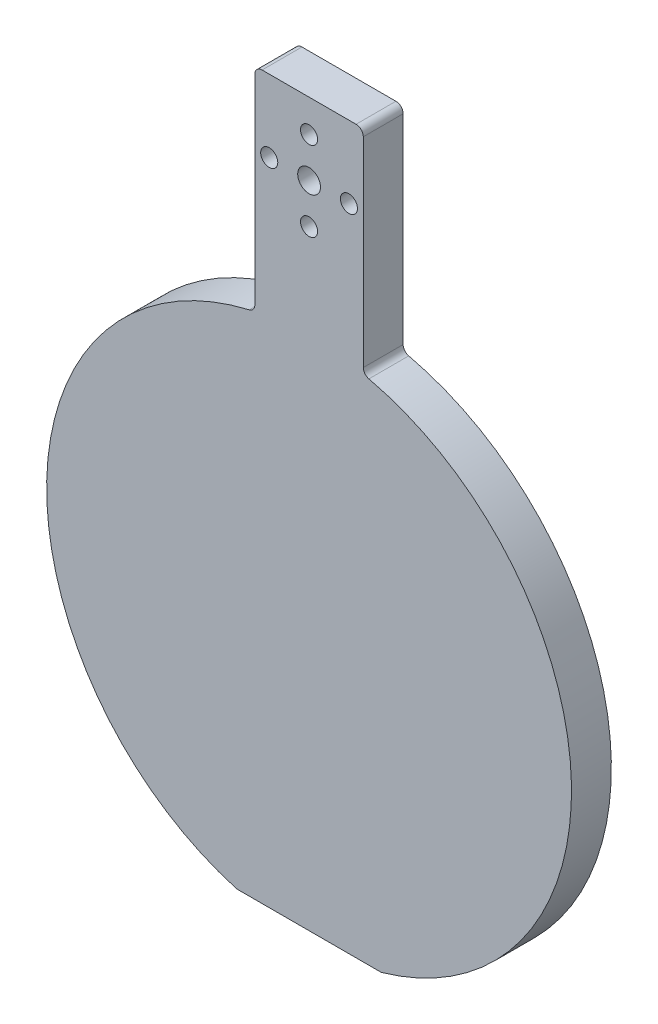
ISO-10303-21;
HEADER;
FILE_DESCRIPTION(('STEP AP214'),'2;1');
FILE_NAME('part.step','',(''),(''),'','','');
FILE_SCHEMA(('AUTOMOTIVE_DESIGN { 1 0 10303 214 1 1 1 1 }'));
ENDSEC;
DATA;
#1=APPLICATION_CONTEXT('core data for automotive mechanical design processes');
#2=APPLICATION_PROTOCOL_DEFINITION('international standard','automotive_design',2000,#1);
#3=PRODUCT_CONTEXT('',#1,'mechanical');
#4=PRODUCT('Part','Part','',(#3));
#5=PRODUCT_RELATED_PRODUCT_CATEGORY('part','',(#4));
#6=PRODUCT_DEFINITION_FORMATION('','',#4);
#7=PRODUCT_DEFINITION_CONTEXT('part definition',#1,'design');
#8=PRODUCT_DEFINITION('design','',#6,#7);
#9=PRODUCT_DEFINITION_SHAPE('','',#8);
#10=(LENGTH_UNIT() NAMED_UNIT(*) SI_UNIT(.MILLI.,.METRE.));
#11=(NAMED_UNIT(*) PLANE_ANGLE_UNIT() SI_UNIT($,.RADIAN.));
#12=(NAMED_UNIT(*) SI_UNIT($,.STERADIAN.) SOLID_ANGLE_UNIT());
#13=UNCERTAINTY_MEASURE_WITH_UNIT(LENGTH_MEASURE(1.E-05),#10,'distance_accuracy_value','');
#14=(GEOMETRIC_REPRESENTATION_CONTEXT(3) GLOBAL_UNCERTAINTY_ASSIGNED_CONTEXT((#13)) GLOBAL_UNIT_ASSIGNED_CONTEXT((#10,
#11,#12)) REPRESENTATION_CONTEXT('',''));
#15=CARTESIAN_POINT('',(0.,0.,0.));
#16=DIRECTION('',(0.,0.,1.));
#17=DIRECTION('',(1.,0.,0.));
#18=AXIS2_PLACEMENT_3D('',#15,#16,#17);
#19=CARTESIAN_POINT('',(0.,0.,7.000000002));
#20=DIRECTION('',(0.,0.,-1.));
#21=DIRECTION('',(-1.,0.,0.));
#22=AXIS2_PLACEMENT_3D('',#19,#20,#21);
#23=CYLINDRICAL_SURFACE('',#22,46.101);
#24=CARTESIAN_POINT('',(0.,0.,7.000000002));
#25=DIRECTION('',(0.,0.,1.));
#26=DIRECTION('',(1.,0.,0.));
#27=AXIS2_PLACEMENT_3D('',#24,#25,#26);
#28=CIRCLE('',#27,46.101);
#29=CARTESIAN_POINT('',(12.7,-44.3171772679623,7.000000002));
#30=VERTEX_POINT('',#29);
#31=CARTESIAN_POINT('',(10.5055898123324,44.888024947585,7.000000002));
#32=VERTEX_POINT('',#31);
#33=EDGE_CURVE('E155',#30,#32,#28,.T.);
#34=ORIENTED_EDGE('',*,*,#33,.F.);
#35=DIRECTION('',(0.,0.,1.));
#36=VECTOR('',#35,1.);
#37=CARTESIAN_POINT('',(12.7,-44.3171772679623,0.));
#38=LINE('',#37,#36);
#39=CARTESIAN_POINT('',(12.7,-44.3171772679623,0.));
#40=VERTEX_POINT('',#39);
#41=EDGE_CURVE('E71',#40,#30,#38,.T.);
#42=ORIENTED_EDGE('',*,*,#41,.F.);
#43=CARTESIAN_POINT('',(0.,0.,0.));
#44=DIRECTION('',(0.,0.,1.));
#45=DIRECTION('',(1.,0.,0.));
#46=AXIS2_PLACEMENT_3D('',#43,#44,#45);
#47=CIRCLE('',#46,46.101);
#48=CARTESIAN_POINT('',(10.5055898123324,44.888024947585,0.));
#49=VERTEX_POINT('',#48);
#50=EDGE_CURVE('E125',#40,#49,#47,.T.);
#51=ORIENTED_EDGE('',*,*,#50,.T.);
#52=DIRECTION('',(0.,0.,-1.));
#53=VECTOR('',#52,1.);
#54=CARTESIAN_POINT('',(10.5055898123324,44.888024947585,7.000000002));
#55=LINE('',#54,#53);
#56=EDGE_CURVE('E128',#32,#49,#55,.T.);
#57=ORIENTED_EDGE('',*,*,#56,.F.);
#58=EDGE_LOOP('',(#34,#42,#51,#57));
#59=FACE_BOUND('',#58,.T.);
#60=ADVANCED_FACE('F41',(#59),#23,.T.);
#61=CARTESIAN_POINT('',(10.795,46.1246096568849,7.000000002));
#62=DIRECTION('',(0.,0.,-1.));
#63=DIRECTION('',(-1.,0.,0.));
#64=AXIS2_PLACEMENT_3D('',#61,#62,#63);
#65=CYLINDRICAL_SURFACE('',#64,1.27);
#66=CARTESIAN_POINT('',(10.795,46.1246096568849,0.));
#67=DIRECTION('',(0.,0.,-1.));
#68=DIRECTION('',(-1.,0.,0.));
#69=AXIS2_PLACEMENT_3D('',#66,#67,#68);
#70=CIRCLE('',#69,1.27);
#71=CARTESIAN_POINT('',(9.525,46.1246096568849,0.));
#72=VERTEX_POINT('',#71);
#73=EDGE_CURVE('E137',#49,#72,#70,.T.);
#74=ORIENTED_EDGE('',*,*,#73,.T.);
#75=DIRECTION('',(0.,0.,-1.));
#76=VECTOR('',#75,1.);
#77=CARTESIAN_POINT('',(9.525,46.1246096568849,7.000000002));
#78=LINE('',#77,#76);
#79=CARTESIAN_POINT('',(9.525,46.1246096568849,7.000000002));
#80=VERTEX_POINT('',#79);
#81=EDGE_CURVE('E11',#80,#72,#78,.T.);
#82=ORIENTED_EDGE('',*,*,#81,.F.);
#83=CARTESIAN_POINT('',(10.795,46.1246096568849,7.000000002));
#84=DIRECTION('',(0.,0.,-1.));
#85=DIRECTION('',(-1.,0.,0.));
#86=AXIS2_PLACEMENT_3D('',#83,#84,#85);
#87=CIRCLE('',#86,1.27);
#88=EDGE_CURVE('E139',#32,#80,#87,.T.);
#89=ORIENTED_EDGE('',*,*,#88,.F.);
#90=ORIENTED_EDGE('',*,*,#56,.T.);
#91=EDGE_LOOP('',(#74,#82,#89,#90));
#92=FACE_BOUND('',#91,.T.);
#93=ADVANCED_FACE('F43',(#92),#65,.F.);
#94=CARTESIAN_POINT('',(9.525,46.1246096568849,7.000000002));
#95=DIRECTION('',(-1.,0.,0.));
#96=DIRECTION('',(0.,-1.,0.));
#97=AXIS2_PLACEMENT_3D('',#94,#95,#96);
#98=PLANE('',#97);
#99=DIRECTION('',(0.,1.,0.));
#100=VECTOR('',#99,1.);
#101=CARTESIAN_POINT('',(9.525,46.1246096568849,0.));
#102=LINE('',#101,#100);
#103=CARTESIAN_POINT('',(9.52500000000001,81.2300001,0.));
#104=VERTEX_POINT('',#103);
#105=EDGE_CURVE('E146',#72,#104,#102,.T.);
#106=ORIENTED_EDGE('',*,*,#105,.T.);
#107=DIRECTION('',(0.,0.,-1.));
#108=VECTOR('',#107,1.);
#109=CARTESIAN_POINT('',(9.52500000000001,81.2300001,7.000000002));
#110=LINE('',#109,#108);
#111=CARTESIAN_POINT('',(9.52500000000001,81.2300001,7.000000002));
#112=VERTEX_POINT('',#111);
#113=EDGE_CURVE('E51',#112,#104,#110,.T.);
#114=ORIENTED_EDGE('',*,*,#113,.F.);
#115=DIRECTION('',(0.,1.,0.));
#116=VECTOR('',#115,1.);
#117=CARTESIAN_POINT('',(9.525,46.1246096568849,7.000000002));
#118=LINE('',#117,#116);
#119=EDGE_CURVE('E246',#80,#112,#118,.T.);
#120=ORIENTED_EDGE('',*,*,#119,.F.);
#121=ORIENTED_EDGE('',*,*,#81,.T.);
#122=EDGE_LOOP('',(#106,#114,#120,#121));
#123=FACE_BOUND('',#122,.T.);
#124=ADVANCED_FACE('F247',(#123),#98,.F.);
#125=CARTESIAN_POINT('',(8.255,81.2300001,7.000000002));
#126=DIRECTION('',(0.,0.,-1.));
#127=DIRECTION('',(-1.,0.,0.));
#128=AXIS2_PLACEMENT_3D('',#125,#126,#127);
#129=CYLINDRICAL_SURFACE('',#128,1.27);
#130=CARTESIAN_POINT('',(8.255,81.2300001,0.));
#131=DIRECTION('',(0.,0.,1.));
#132=DIRECTION('',(-1.,0.,0.));
#133=AXIS2_PLACEMENT_3D('',#130,#131,#132);
#134=CIRCLE('',#133,1.27);
#135=CARTESIAN_POINT('',(8.255,82.5000001,0.));
#136=VERTEX_POINT('',#135);
#137=EDGE_CURVE('E149',#104,#136,#134,.T.);
#138=ORIENTED_EDGE('',*,*,#137,.T.);
#139=DIRECTION('',(0.,0.,-1.));
#140=VECTOR('',#139,1.);
#141=CARTESIAN_POINT('',(8.255,82.5000001,7.000000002));
#142=LINE('',#141,#140);
#143=CARTESIAN_POINT('',(8.255,82.5000001,7.000000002));
#144=VERTEX_POINT('',#143);
#145=EDGE_CURVE('E176',#144,#136,#142,.T.);
#146=ORIENTED_EDGE('',*,*,#145,.F.);
#147=CARTESIAN_POINT('',(8.255,81.2300001,7.000000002));
#148=DIRECTION('',(0.,0.,1.));
#149=DIRECTION('',(-1.,0.,0.));
#150=AXIS2_PLACEMENT_3D('',#147,#148,#149);
#151=CIRCLE('',#150,1.27);
#152=EDGE_CURVE('E185',#112,#144,#151,.T.);
#153=ORIENTED_EDGE('',*,*,#152,.F.);
#154=ORIENTED_EDGE('',*,*,#113,.T.);
#155=EDGE_LOOP('',(#138,#146,#153,#154));
#156=FACE_BOUND('',#155,.T.);
#157=ADVANCED_FACE('F183',(#156),#129,.T.);
#158=CARTESIAN_POINT('',(-8.255,82.5000001,7.000000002));
#159=DIRECTION('',(0.,-1.,0.));
#160=DIRECTION('',(0.,0.,-1.));
#161=AXIS2_PLACEMENT_3D('',#158,#159,#160);
#162=PLANE('',#161);
#163=DIRECTION('',(-1.,0.,0.));
#164=VECTOR('',#163,1.);
#165=CARTESIAN_POINT('',(-8.255,82.5000001,0.));
#166=LINE('',#165,#164);
#167=CARTESIAN_POINT('',(-8.255,82.5000001,0.));
#168=VERTEX_POINT('',#167);
#169=EDGE_CURVE('E159',#136,#168,#166,.T.);
#170=ORIENTED_EDGE('',*,*,#169,.T.);
#171=DIRECTION('',(0.,0.,-1.));
#172=VECTOR('',#171,1.);
#173=CARTESIAN_POINT('',(-8.255,82.5000001,7.000000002));
#174=LINE('',#173,#172);
#175=CARTESIAN_POINT('',(-8.255,82.5000001,7.000000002));
#176=VERTEX_POINT('',#175);
#177=EDGE_CURVE('E173',#176,#168,#174,.T.);
#178=ORIENTED_EDGE('',*,*,#177,.F.);
#179=DIRECTION('',(-1.,0.,0.));
#180=VECTOR('',#179,1.);
#181=CARTESIAN_POINT('',(-8.255,82.5000001,7.000000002));
#182=LINE('',#181,#180);
#183=EDGE_CURVE('E202',#144,#176,#182,.T.);
#184=ORIENTED_EDGE('',*,*,#183,.F.);
#185=ORIENTED_EDGE('',*,*,#145,.T.);
#186=EDGE_LOOP('',(#170,#178,#184,#185));
#187=FACE_BOUND('',#186,.T.);
#188=ADVANCED_FACE('F192',(#187),#162,.F.);
#189=CARTESIAN_POINT('',(-8.255,81.2300001,7.000000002));
#190=DIRECTION('',(0.,0.,-1.));
#191=DIRECTION('',(-1.,0.,0.));
#192=AXIS2_PLACEMENT_3D('',#189,#190,#191);
#193=CYLINDRICAL_SURFACE('',#192,1.27);
#194=CARTESIAN_POINT('',(-8.255,81.2300001,0.));
#195=DIRECTION('',(0.,0.,1.));
#196=DIRECTION('',(-1.,0.,0.));
#197=AXIS2_PLACEMENT_3D('',#194,#195,#196);
#198=CIRCLE('',#197,1.27);
#199=CARTESIAN_POINT('',(-9.525,81.2300001,0.));
#200=VERTEX_POINT('',#199);
#201=EDGE_CURVE('E161',#168,#200,#198,.T.);
#202=ORIENTED_EDGE('',*,*,#201,.T.);
#203=DIRECTION('',(0.,0.,-1.));
#204=VECTOR('',#203,1.);
#205=CARTESIAN_POINT('',(-9.525,81.2300001,7.000000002));
#206=LINE('',#205,#204);
#207=CARTESIAN_POINT('',(-9.525,81.2300001,7.000000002));
#208=VERTEX_POINT('',#207);
#209=EDGE_CURVE('E170',#208,#200,#206,.T.);
#210=ORIENTED_EDGE('',*,*,#209,.F.);
#211=CARTESIAN_POINT('',(-8.255,81.2300001,7.000000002));
#212=DIRECTION('',(0.,0.,1.));
#213=DIRECTION('',(-1.,0.,0.));
#214=AXIS2_PLACEMENT_3D('',#211,#212,#213);
#215=CIRCLE('',#214,1.27);
#216=EDGE_CURVE('E198',#176,#208,#215,.T.);
#217=ORIENTED_EDGE('',*,*,#216,.F.);
#218=ORIENTED_EDGE('',*,*,#177,.T.);
#219=EDGE_LOOP('',(#202,#210,#217,#218));
#220=FACE_BOUND('',#219,.T.);
#221=ADVANCED_FACE('F196',(#220),#193,.T.);
#222=CARTESIAN_POINT('',(-9.525,46.1246096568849,7.000000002));
#223=DIRECTION('',(1.,0.,0.));
#224=DIRECTION('',(0.,1.,0.));
#225=AXIS2_PLACEMENT_3D('',#222,#223,#224);
#226=PLANE('',#225);
#227=DIRECTION('',(0.,-1.,0.));
#228=VECTOR('',#227,1.);
#229=CARTESIAN_POINT('',(-9.525,46.1246096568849,0.));
#230=LINE('',#229,#228);
#231=CARTESIAN_POINT('',(-9.525,46.1246096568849,0.));
#232=VERTEX_POINT('',#231);
#233=EDGE_CURVE('E163',#200,#232,#230,.T.);
#234=ORIENTED_EDGE('',*,*,#233,.T.);
#235=DIRECTION('',(0.,0.,-1.));
#236=VECTOR('',#235,1.);
#237=CARTESIAN_POINT('',(-9.525,46.1246096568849,7.000000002));
#238=LINE('',#237,#236);
#239=CARTESIAN_POINT('',(-9.525,46.1246096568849,7.000000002));
#240=VERTEX_POINT('',#239);
#241=EDGE_CURVE('E168',#240,#232,#238,.T.);
#242=ORIENTED_EDGE('',*,*,#241,.F.);
#243=DIRECTION('',(0.,-1.,0.));
#244=VECTOR('',#243,1.);
#245=CARTESIAN_POINT('',(-9.525,46.1246096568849,7.000000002));
#246=LINE('',#245,#244);
#247=EDGE_CURVE('E201',#208,#240,#246,.T.);
#248=ORIENTED_EDGE('',*,*,#247,.F.);
#249=ORIENTED_EDGE('',*,*,#209,.T.);
#250=EDGE_LOOP('',(#234,#242,#248,#249));
#251=FACE_BOUND('',#250,.T.);
#252=ADVANCED_FACE('F269',(#251),#226,.F.);
#253=CARTESIAN_POINT('',(-10.795,46.1246096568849,7.000000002));
#254=DIRECTION('',(0.,0.,-1.));
#255=DIRECTION('',(-1.,0.,0.));
#256=AXIS2_PLACEMENT_3D('',#253,#254,#255);
#257=CYLINDRICAL_SURFACE('',#256,1.27);
#258=CARTESIAN_POINT('',(-10.795,46.1246096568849,0.));
#259=DIRECTION('',(0.,0.,-1.));
#260=DIRECTION('',(1.,0.,0.));
#261=AXIS2_PLACEMENT_3D('',#258,#259,#260);
#262=CIRCLE('',#261,1.27);
#263=CARTESIAN_POINT('',(-10.5055898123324,44.888024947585,0.));
#264=VERTEX_POINT('',#263);
#265=EDGE_CURVE('E119',#232,#264,#262,.T.);
#266=ORIENTED_EDGE('',*,*,#265,.T.);
#267=DIRECTION('',(0.,0.,-1.));
#268=VECTOR('',#267,1.);
#269=CARTESIAN_POINT('',(-10.5055898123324,44.888024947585,7.000000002));
#270=LINE('',#269,#268);
#271=CARTESIAN_POINT('',(-10.5055898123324,44.888024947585,7.000000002));
#272=VERTEX_POINT('',#271);
#273=EDGE_CURVE('E140',#272,#264,#270,.T.);
#274=ORIENTED_EDGE('',*,*,#273,.F.);
#275=CARTESIAN_POINT('',(-10.795,46.1246096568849,7.000000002));
#276=DIRECTION('',(0.,0.,-1.));
#277=DIRECTION('',(1.,0.,0.));
#278=AXIS2_PLACEMENT_3D('',#275,#276,#277);
#279=CIRCLE('',#278,1.27);
#280=EDGE_CURVE('E204',#240,#272,#279,.T.);
#281=ORIENTED_EDGE('',*,*,#280,.F.);
#282=ORIENTED_EDGE('',*,*,#241,.T.);
#283=EDGE_LOOP('',(#266,#274,#281,#282));
#284=FACE_BOUND('',#283,.T.);
#285=ADVANCED_FACE('F262',(#284),#257,.F.);
#286=CARTESIAN_POINT('',(-12.7000000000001,-44.3171772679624,0.));
#287=VERTEX_POINT('',#286);
#288=EDGE_CURVE('E132',#264,#287,#47,.T.);
#289=ORIENTED_EDGE('',*,*,#288,.T.);
#290=DIRECTION('',(0.,0.,1.));
#291=VECTOR('',#290,1.);
#292=CARTESIAN_POINT('',(-12.7,-44.3171772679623,0.));
#293=LINE('',#292,#291);
#294=CARTESIAN_POINT('',(-12.7,-44.3171772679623,7.000000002));
#295=VERTEX_POINT('',#294);
#296=EDGE_CURVE('E59',#287,#295,#293,.T.);
#297=ORIENTED_EDGE('',*,*,#296,.T.);
#298=EDGE_CURVE('E141',#272,#295,#28,.T.);
#299=ORIENTED_EDGE('',*,*,#298,.F.);
#300=ORIENTED_EDGE('',*,*,#273,.T.);
#301=EDGE_LOOP('',(#289,#297,#299,#300));
#302=FACE_BOUND('',#301,.T.);
#303=ADVANCED_FACE('F213',(#302),#23,.T.);
#304=CARTESIAN_POINT('',(10.795,46.1246096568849,7.000000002));
#305=DIRECTION('',(0.,0.,-1.));
#306=DIRECTION('',(-1.,0.,0.));
#307=AXIS2_PLACEMENT_3D('',#304,#305,#306);
#308=PLANE('',#307);
#309=CARTESIAN_POINT('',(0.,62.8000001,7.000000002));
#310=DIRECTION('',(0.,0.,-1.));
#311=DIRECTION('',(-1.,0.,0.));
#312=AXIS2_PLACEMENT_3D('',#309,#310,#311);
#313=CIRCLE('',#312,1.5);
#314=CARTESIAN_POINT('',(-1.5,62.8000001,7.000000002));
#315=VERTEX_POINT('',#314);
#316=EDGE_CURVE('E147',#315,#315,#313,.T.);
#317=ORIENTED_EDGE('',*,*,#316,.T.);
#318=EDGE_LOOP('',(#317));
#319=FACE_BOUND('',#318,.T.);
#320=CARTESIAN_POINT('',(0.,76.8000001,7.000000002));
#321=DIRECTION('',(0.,0.,-1.));
#322=DIRECTION('',(-1.,0.,0.));
#323=AXIS2_PLACEMENT_3D('',#320,#321,#322);
#324=CIRCLE('',#323,1.5);
#325=CARTESIAN_POINT('',(-1.5,76.8000001,7.000000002));
#326=VERTEX_POINT('',#325);
#327=EDGE_CURVE('E152',#326,#326,#324,.T.);
#328=ORIENTED_EDGE('',*,*,#327,.T.);
#329=EDGE_LOOP('',(#328));
#330=FACE_BOUND('',#329,.T.);
#331=CARTESIAN_POINT('',(6.99999999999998,69.8000001,7.000000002));
#332=DIRECTION('',(0.,0.,-1.));
#333=DIRECTION('',(-1.,0.,0.));
#334=AXIS2_PLACEMENT_3D('',#331,#332,#333);
#335=CIRCLE('',#334,1.5);
#336=CARTESIAN_POINT('',(5.49999999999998,69.8000001,7.000000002));
#337=VERTEX_POINT('',#336);
#338=EDGE_CURVE('E240',#337,#337,#335,.T.);
#339=ORIENTED_EDGE('',*,*,#338,.T.);
#340=EDGE_LOOP('',(#339));
#341=FACE_BOUND('',#340,.T.);
#342=CARTESIAN_POINT('',(-7.00000000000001,69.8000001,7.000000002));
#343=DIRECTION('',(0.,0.,-1.));
#344=DIRECTION('',(-1.,0.,0.));
#345=AXIS2_PLACEMENT_3D('',#342,#343,#344);
#346=CIRCLE('',#345,1.5);
#347=CARTESIAN_POINT('',(-8.50000000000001,69.8000001,7.000000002));
#348=VERTEX_POINT('',#347);
#349=EDGE_CURVE('E237',#348,#348,#346,.T.);
#350=ORIENTED_EDGE('',*,*,#349,.T.);
#351=EDGE_LOOP('',(#350));
#352=FACE_BOUND('',#351,.T.);
#353=CARTESIAN_POINT('',(0.,69.8000001,7.000000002));
#354=DIRECTION('',(0.,0.,-1.));
#355=DIRECTION('',(-1.,0.,0.));
#356=AXIS2_PLACEMENT_3D('',#353,#354,#355);
#357=CIRCLE('',#356,2.);
#358=CARTESIAN_POINT('',(-2.,69.8000001,7.000000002));
#359=VERTEX_POINT('',#358);
#360=EDGE_CURVE('E234',#359,#359,#357,.T.);
#361=ORIENTED_EDGE('',*,*,#360,.T.);
#362=EDGE_LOOP('',(#361));
#363=FACE_BOUND('',#362,.T.);
#364=ORIENTED_EDGE('',*,*,#298,.T.);
#365=DIRECTION('',(1.,0.,0.));
#366=VECTOR('',#365,1.);
#367=CARTESIAN_POINT('',(-12.7,-44.3171772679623,7.000000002));
#368=LINE('',#367,#366);
#369=EDGE_CURVE('E45',#30,#295,#368,.F.);
#370=ORIENTED_EDGE('',*,*,#369,.F.);
#371=ORIENTED_EDGE('',*,*,#33,.T.);
#372=ORIENTED_EDGE('',*,*,#88,.T.);
#373=ORIENTED_EDGE('',*,*,#119,.T.);
#374=ORIENTED_EDGE('',*,*,#152,.T.);
#375=ORIENTED_EDGE('',*,*,#183,.T.);
#376=ORIENTED_EDGE('',*,*,#216,.T.);
#377=ORIENTED_EDGE('',*,*,#247,.T.);
#378=ORIENTED_EDGE('',*,*,#280,.T.);
#379=EDGE_LOOP('',(#364,#370,#371,#372,#373,#374,#375,#376,#377,#378));
#380=FACE_BOUND('',#379,.T.);
#381=ADVANCED_FACE('F211',(#319,#330,#341,#352,#363,#380),#308,.F.);
#382=CARTESIAN_POINT('',(10.795,46.1246096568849,0.));
#383=DIRECTION('',(0.,0.,-1.));
#384=DIRECTION('',(-1.,0.,0.));
#385=AXIS2_PLACEMENT_3D('',#382,#383,#384);
#386=PLANE('',#385);
#387=DIRECTION('',(-1.,0.,0.));
#388=VECTOR('',#387,1.);
#389=CARTESIAN_POINT('',(-12.7,-44.3171772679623,0.));
#390=LINE('',#389,#388);
#391=EDGE_CURVE('E75',#40,#287,#390,.T.);
#392=ORIENTED_EDGE('',*,*,#391,.T.);
#393=ORIENTED_EDGE('',*,*,#288,.F.);
#394=ORIENTED_EDGE('',*,*,#265,.F.);
#395=ORIENTED_EDGE('',*,*,#233,.F.);
#396=ORIENTED_EDGE('',*,*,#201,.F.);
#397=ORIENTED_EDGE('',*,*,#169,.F.);
#398=ORIENTED_EDGE('',*,*,#137,.F.);
#399=ORIENTED_EDGE('',*,*,#105,.F.);
#400=ORIENTED_EDGE('',*,*,#73,.F.);
#401=ORIENTED_EDGE('',*,*,#50,.F.);
#402=EDGE_LOOP('',(#392,#393,#394,#395,#396,#397,#398,#399,#400,#401));
#403=FACE_BOUND('',#402,.T.);
#404=CARTESIAN_POINT('',(0.,62.8000001,0.));
#405=DIRECTION('',(0.,0.,1.));
#406=DIRECTION('',(1.,0.,0.));
#407=AXIS2_PLACEMENT_3D('',#404,#405,#406);
#408=CIRCLE('',#407,1.5);
#409=CARTESIAN_POINT('',(1.5,62.8000001,0.));
#410=VERTEX_POINT('',#409);
#411=EDGE_CURVE('E226',#410,#410,#408,.T.);
#412=ORIENTED_EDGE('',*,*,#411,.T.);
#413=EDGE_LOOP('',(#412));
#414=FACE_BOUND('',#413,.T.);
#415=CARTESIAN_POINT('',(0.,76.8000001,0.));
#416=DIRECTION('',(0.,0.,1.));
#417=DIRECTION('',(1.,0.,0.));
#418=AXIS2_PLACEMENT_3D('',#415,#416,#417);
#419=CIRCLE('',#418,1.5);
#420=CARTESIAN_POINT('',(1.5,76.8000001,0.));
#421=VERTEX_POINT('',#420);
#422=EDGE_CURVE('E223',#421,#421,#419,.T.);
#423=ORIENTED_EDGE('',*,*,#422,.T.);
#424=EDGE_LOOP('',(#423));
#425=FACE_BOUND('',#424,.T.);
#426=CARTESIAN_POINT('',(6.99999999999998,69.8000001,0.));
#427=DIRECTION('',(0.,0.,1.));
#428=DIRECTION('',(1.,0.,0.));
#429=AXIS2_PLACEMENT_3D('',#426,#427,#428);
#430=CIRCLE('',#429,1.5);
#431=CARTESIAN_POINT('',(8.49999999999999,69.8000001,0.));
#432=VERTEX_POINT('',#431);
#433=EDGE_CURVE('E220',#432,#432,#430,.T.);
#434=ORIENTED_EDGE('',*,*,#433,.T.);
#435=EDGE_LOOP('',(#434));
#436=FACE_BOUND('',#435,.T.);
#437=CARTESIAN_POINT('',(-7.00000000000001,69.8000001,0.));
#438=DIRECTION('',(0.,0.,1.));
#439=DIRECTION('',(1.,0.,0.));
#440=AXIS2_PLACEMENT_3D('',#437,#438,#439);
#441=CIRCLE('',#440,1.5);
#442=CARTESIAN_POINT('',(-5.50000000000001,69.8000001,0.));
#443=VERTEX_POINT('',#442);
#444=EDGE_CURVE('E216',#443,#443,#441,.T.);
#445=ORIENTED_EDGE('',*,*,#444,.T.);
#446=EDGE_LOOP('',(#445));
#447=FACE_BOUND('',#446,.T.);
#448=CARTESIAN_POINT('',(0.,69.8000001,0.));
#449=DIRECTION('',(0.,0.,1.));
#450=DIRECTION('',(1.,0.,0.));
#451=AXIS2_PLACEMENT_3D('',#448,#449,#450);
#452=CIRCLE('',#451,2.);
#453=CARTESIAN_POINT('',(2.,69.8000001,0.));
#454=VERTEX_POINT('',#453);
#455=EDGE_CURVE('E229',#454,#454,#452,.T.);
#456=ORIENTED_EDGE('',*,*,#455,.T.);
#457=EDGE_LOOP('',(#456));
#458=FACE_BOUND('',#457,.T.);
#459=ADVANCED_FACE('F143',(#403,#414,#425,#436,#447,#458),#386,.T.);
#460=CARTESIAN_POINT('',(0.,69.8000001,0.));
#461=DIRECTION('',(0.,0.,1.));
#462=DIRECTION('',(1.,0.,0.));
#463=AXIS2_PLACEMENT_3D('',#460,#461,#462);
#464=CYLINDRICAL_SURFACE('',#463,2.);
#465=ORIENTED_EDGE('',*,*,#455,.F.);
#466=EDGE_LOOP('',(#465));
#467=FACE_BOUND('',#466,.T.);
#468=ORIENTED_EDGE('',*,*,#360,.F.);
#469=EDGE_LOOP('',(#468));
#470=FACE_BOUND('',#469,.T.);
#471=ADVANCED_FACE('F318',(#467,#470),#464,.F.);
#472=CARTESIAN_POINT('',(-7.00000000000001,69.8000001,0.));
#473=DIRECTION('',(0.,0.,1.));
#474=DIRECTION('',(1.,0.,0.));
#475=AXIS2_PLACEMENT_3D('',#472,#473,#474);
#476=CYLINDRICAL_SURFACE('',#475,1.5);
#477=ORIENTED_EDGE('',*,*,#444,.F.);
#478=EDGE_LOOP('',(#477));
#479=FACE_BOUND('',#478,.T.);
#480=ORIENTED_EDGE('',*,*,#349,.F.);
#481=EDGE_LOOP('',(#480));
#482=FACE_BOUND('',#481,.T.);
#483=ADVANCED_FACE('F326',(#479,#482),#476,.F.);
#484=CARTESIAN_POINT('',(6.99999999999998,69.8000001,0.));
#485=DIRECTION('',(0.,0.,1.));
#486=DIRECTION('',(1.,0.,0.));
#487=AXIS2_PLACEMENT_3D('',#484,#485,#486);
#488=CYLINDRICAL_SURFACE('',#487,1.5);
#489=ORIENTED_EDGE('',*,*,#433,.F.);
#490=EDGE_LOOP('',(#489));
#491=FACE_BOUND('',#490,.T.);
#492=ORIENTED_EDGE('',*,*,#338,.F.);
#493=EDGE_LOOP('',(#492));
#494=FACE_BOUND('',#493,.T.);
#495=ADVANCED_FACE('F336',(#491,#494),#488,.F.);
#496=CARTESIAN_POINT('',(0.,76.8000001,0.));
#497=DIRECTION('',(0.,0.,1.));
#498=DIRECTION('',(1.,0.,0.));
#499=AXIS2_PLACEMENT_3D('',#496,#497,#498);
#500=CYLINDRICAL_SURFACE('',#499,1.5);
#501=ORIENTED_EDGE('',*,*,#422,.F.);
#502=EDGE_LOOP('',(#501));
#503=FACE_BOUND('',#502,.T.);
#504=ORIENTED_EDGE('',*,*,#327,.F.);
#505=EDGE_LOOP('',(#504));
#506=FACE_BOUND('',#505,.T.);
#507=ADVANCED_FACE('F346',(#503,#506),#500,.F.);
#508=CARTESIAN_POINT('',(0.,62.8000001,0.));
#509=DIRECTION('',(0.,0.,1.));
#510=DIRECTION('',(1.,0.,0.));
#511=AXIS2_PLACEMENT_3D('',#508,#509,#510);
#512=CYLINDRICAL_SURFACE('',#511,1.5);
#513=ORIENTED_EDGE('',*,*,#411,.F.);
#514=EDGE_LOOP('',(#513));
#515=FACE_BOUND('',#514,.T.);
#516=ORIENTED_EDGE('',*,*,#316,.F.);
#517=EDGE_LOOP('',(#516));
#518=FACE_BOUND('',#517,.T.);
#519=ADVANCED_FACE('F356',(#515,#518),#512,.F.);
#520=CARTESIAN_POINT('',(-12.7,-44.3171772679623,0.));
#521=DIRECTION('',(0.,1.,0.));
#522=DIRECTION('',(0.,0.,1.));
#523=AXIS2_PLACEMENT_3D('',#520,#521,#522);
#524=PLANE('',#523);
#525=ORIENTED_EDGE('',*,*,#296,.F.);
#526=ORIENTED_EDGE('',*,*,#391,.F.);
#527=ORIENTED_EDGE('',*,*,#41,.T.);
#528=ORIENTED_EDGE('',*,*,#369,.T.);
#529=EDGE_LOOP('',(#525,#526,#527,#528));
#530=FACE_BOUND('',#529,.T.);
#531=ADVANCED_FACE('F365',(#530),#524,.F.);
#532=CLOSED_SHELL('',(#60,#93,#124,#157,#188,#221,#252,#285,#303,#381,#459,#471,#483,#495,#507,
#519,#531));
#533=MANIFOLD_SOLID_BREP('B2',#532);
#534=ADVANCED_BREP_SHAPE_REPRESENTATION('',(#18,#533),#14);
#535=SHAPE_DEFINITION_REPRESENTATION(#9,#534);
ENDSEC;
END-ISO-10303-21;
